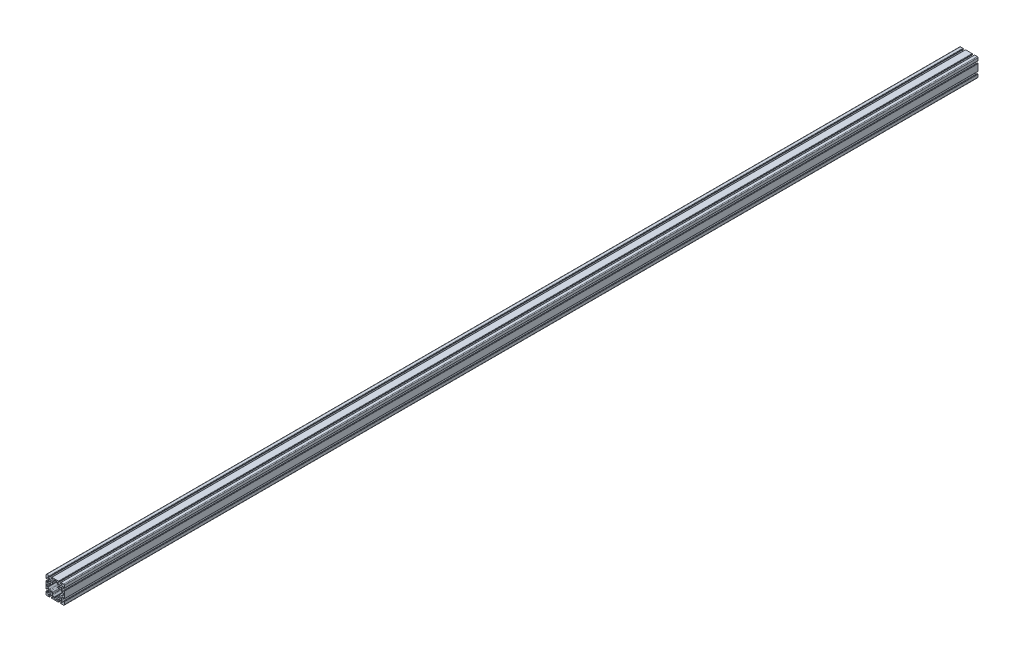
from build123d import *

# Parameters (mm, degrees)
SKETCH1_R      = 3.4
EXTRUDE1_DEPTH = 4000


with BuildPart() as part:
    # Sketch1 → Extrude1 (new body)
    with BuildSketch(Plane.XY):
        with BuildLine():
            Line((29.091242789, 26.036541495), (33.082657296, 30.027956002))
            ThreePointArc((33.082657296, 30.027956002), (33.329219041, 30.192703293), (33.62005845, 30.250554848))
            Line((33.62005845, 30.250554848), (33.955571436, 30.250554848))
            ThreePointArc((33.955571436, 30.250554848), (35.065729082, 29.790712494), (35.525571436, 28.680554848))
            Line((35.525571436, 28.680554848), (35.525571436, 25.777866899))
            ThreePointArc((35.525571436, 25.777866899), (35.985413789, 24.667709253), (37.095571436, 24.207866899))
            Line((37.095571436, 24.207866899), (38.43, 24.207866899))
            ThreePointArc((38.43, 24.207866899), (39.540157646, 24.667709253), (40, 25.777866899))
            Line((40, 25.777866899), (40, 32.933852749))
            Line((40, 32.933852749), (40, 36.83))
            ThreePointArc((40, 36.83), (39.071528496, 39.071528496), (36.83, 40))
            Line((36.83, 40), (25.540851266, 40))
            ThreePointArc((25.540851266, 40), (24.43069362, 39.540157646), (23.970851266, 38.43))
            Line((23.970851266, 38.43), (23.970851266, 37.249043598))
            ThreePointArc((23.970851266, 37.249043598), (24.43069362, 36.138885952), (25.540851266, 35.679043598))
            Line((25.540851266, 35.679043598), (28.625762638, 35.679043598))
            ThreePointArc((28.625762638, 35.679043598), (29.77116849, 35.239363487), (30.250554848, 34.11))
            Line((30.250554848, 34.11), (30.250554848, 33.62005845))
            ThreePointArc((30.250554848, 33.62005845), (30.192703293, 33.329219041), (30.027956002, 33.082657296))
            Line((30.027956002, 33.082657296), (26.036541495, 29.091242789))
            ThreePointArc((26.036541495, 29.091242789), (24.495530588, 28.061572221), (22.677784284, 27.7))
            Line((22.677784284, 27.7), (17.322215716, 27.7))
            ThreePointArc((17.322215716, 27.7), (15.504469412, 28.061572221), (13.963458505, 29.091242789))
            Line((13.963458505, 29.091242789), (9.90393336, 33.150767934))
            ThreePointArc((9.90393336, 33.150767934), (9.764102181, 33.360040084), (9.715, 33.606893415))
            Line((9.715, 33.606893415), (9.715, 34.096834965))
            ThreePointArc((9.715, 34.096834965), (10.178698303, 35.216301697), (11.298165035, 35.68))
            Line((11.298165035, 35.68), (14.642754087, 35.68))
            ThreePointArc((14.642754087, 35.68), (15.560045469, 36.059954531), (15.94, 36.977245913))
            Line((15.94, 36.977245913), (15.94, 38.194841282))
            ThreePointArc((15.94, 38.194841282), (15.411281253, 39.471281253), (14.134841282, 40))
            Line((14.134841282, 40), (6.984433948, 40))
            Line((6.984433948, 40), (-6.984433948, 40))
            Line((-6.984433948, 40), (-14.134841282, 40))
            ThreePointArc((-14.134841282, 40), (-15.411281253, 39.471281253), (-15.94, 38.194841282))
            Line((-15.94, 38.194841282), (-15.94, 36.977245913))
            ThreePointArc((-15.94, 36.977245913), (-15.560045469, 36.059954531), (-14.642754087, 35.68))
            Line((-14.642754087, 35.68), (-11.298165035, 35.68))
            ThreePointArc((-11.298165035, 35.68), (-10.178698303, 35.216301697), (-9.715, 34.096834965))
            Line((-9.715, 34.096834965), (-9.715, 33.606893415))
            ThreePointArc((-9.715, 33.606893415), (-9.764102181, 33.360040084), (-9.90393336, 33.150767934))
            Line((-9.90393336, 33.150767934), (-13.963458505, 29.091242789))
            ThreePointArc((-13.963458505, 29.091242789), (-15.504469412, 28.061572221), (-17.322215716, 27.7))
            Line((-17.322215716, 27.7), (-22.677784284, 27.7))
            ThreePointArc((-22.677784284, 27.7), (-24.495530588, 28.061572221), (-26.036541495, 29.091242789))
            Line((-26.036541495, 29.091242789), (-30.09606664, 33.150767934))
            ThreePointArc((-30.09606664, 33.150767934), (-30.235897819, 33.360040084), (-30.285, 33.606893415))
            Line((-30.285, 33.606893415), (-30.285, 34.096834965))
            ThreePointArc((-30.285, 34.096834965), (-29.821301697, 35.216301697), (-28.701834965, 35.68))
            Line((-28.701834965, 35.68), (-25.357245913, 35.68))
            ThreePointArc((-25.357245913, 35.68), (-24.439954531, 36.059954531), (-24.06, 36.977245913))
            Line((-24.06, 36.977245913), (-24.06, 38.194841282))
            ThreePointArc((-24.06, 38.194841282), (-24.588718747, 39.471281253), (-25.865158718, 40))
            Line((-25.865158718, 40), (-33.031395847, 40))
            Line((-33.031395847, 40), (-36.83, 40))
            ThreePointArc((-36.83, 40), (-39.071528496, 39.071528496), (-40, 36.83))
            Line((-40, 36.83), (-40, 33.318079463))
            Line((-40, 33.318079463), (-40, 25.865158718))
            ThreePointArc((-40, 25.865158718), (-39.471281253, 24.588718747), (-38.194841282, 24.06))
            Line((-38.194841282, 24.06), (-36.977245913, 24.06))
            ThreePointArc((-36.977245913, 24.06), (-36.059954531, 24.439954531), (-35.68, 25.357245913))
            Line((-35.68, 25.357245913), (-35.68, 28.680554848))
            ThreePointArc((-35.68, 28.680554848), (-35.220157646, 29.790712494), (-34.11, 30.250554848))
            Line((-34.11, 30.250554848), (-33.62005845, 30.250554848))
            ThreePointArc((-33.62005845, 30.250554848), (-33.329219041, 30.192703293), (-33.082657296, 30.027956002))
            Line((-33.082657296, 30.027956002), (-29.091242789, 26.036541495))
            ThreePointArc((-29.091242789, 26.036541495), (-28.061572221, 24.495530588), (-27.7, 22.677784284))
            Line((-27.7, 22.677784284), (-27.7, 17.322215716))
            ThreePointArc((-27.7, 17.322215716), (-28.061572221, 15.504469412), (-29.091242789, 13.963458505))
            Line((-29.091242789, 13.963458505), (-33.082657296, 9.972043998))
            ThreePointArc((-33.082657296, 9.972043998), (-33.329219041, 9.807296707), (-33.62005845, 9.749445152))
            Line((-33.62005845, 9.749445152), (-34.11, 9.749445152))
            ThreePointArc((-34.11, 9.749445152), (-35.220157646, 10.209287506), (-35.68, 11.319445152))
            Line((-35.68, 11.319445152), (-35.68, 14.642754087))
            ThreePointArc((-35.68, 14.642754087), (-36.059954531, 15.560045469), (-36.977245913, 15.94))
            Line((-36.977245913, 15.94), (-38.194841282, 15.94))
            ThreePointArc((-38.194841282, 15.94), (-39.471281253, 15.411281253), (-40, 14.134841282))
            Line((-40, 14.134841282), (-40, 7.016888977))
            Line((-40, 7.016888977), (-40, -7.016888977))
            Line((-40, -7.016888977), (-40, -14.447338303))
            ThreePointArc((-40, -14.447338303), (-39.540157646, -15.557495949), (-38.43, -16.017338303))
            Line((-38.43, -16.017338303), (-37.25, -16.017338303))
            ThreePointArc((-37.25, -16.017338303), (-36.139842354, -15.557495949), (-35.68, -14.447338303))
            Line((-35.68, -14.447338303), (-35.68, -11.319445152))
            ThreePointArc((-35.68, -11.319445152), (-35.220157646, -10.209287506), (-34.11, -9.749445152))
            Line((-34.11, -9.749445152), (-33.62005845, -9.749445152))
            ThreePointArc((-33.62005845, -9.749445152), (-33.329219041, -9.807296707), (-33.082657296, -9.972043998))
            Line((-33.082657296, -9.972043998), (-29.091242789, -13.963458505))
            ThreePointArc((-29.091242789, -13.963458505), (-28.061572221, -15.504469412), (-27.7, -17.322215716))
            Line((-27.7, -17.322215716), (-27.7, -22.677784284))
            ThreePointArc((-27.7, -22.677784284), (-28.061572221, -24.495530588), (-29.091242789, -26.036541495))
            Line((-29.091242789, -26.036541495), (-32.871776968, -29.817075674))
            ThreePointArc((-32.871776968, -29.817075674), (-33.10612883, -29.976640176), (-33.382654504, -30.039211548))
            Line((-33.382654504, -30.039211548), (-34.05520779, -30.062697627))
            ThreePointArc((-34.05520779, -30.062697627), (-35.200613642, -29.623017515), (-35.68, -28.493654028))
            Line((-35.68, -28.493654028), (-35.68, -25.59096608))
            ThreePointArc((-35.68, -25.59096608), (-36.139842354, -24.480808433), (-37.25, -24.02096608))
            Line((-37.25, -24.02096608), (-38.43, -24.02096608))
            ThreePointArc((-38.43, -24.02096608), (-39.540157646, -24.480808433), (-40, -25.59096608))
            Line((-40, -25.59096608), (-40, -33.019082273))
            Line((-40, -33.019082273), (-40, -36.83))
            ThreePointArc((-40, -36.83), (-39.071528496, -39.071528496), (-36.83, -40))
            Line((-36.83, -40), (-33, -40))
            Line((-33, -40), (-25.72307469, -40))
            ThreePointArc((-25.72307469, -40), (-24.612917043, -39.540157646), (-24.15307469, -38.43))
            Line((-24.15307469, -38.43), (-24.15307469, -37.25))
            ThreePointArc((-24.15307469, -37.25), (-24.612917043, -36.139842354), (-25.72307469, -35.68))
            Line((-25.72307469, -35.68), (-28.680554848, -35.68))
            ThreePointArc((-28.680554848, -35.68), (-29.790712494, -35.220157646), (-30.250554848, -34.11))
            Line((-30.250554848, -34.11), (-30.250554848, -33.62005845))
            ThreePointArc((-30.250554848, -33.62005845), (-30.192703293, -33.329219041), (-30.027956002, -33.082657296))
            Line((-30.027956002, -33.082657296), (-26.036541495, -29.091242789))
            ThreePointArc((-26.036541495, -29.091242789), (-24.495530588, -28.061572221), (-22.677784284, -27.7))
            Line((-22.677784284, -27.7), (-17.322215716, -27.7))
            ThreePointArc((-17.322215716, -27.7), (-15.504469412, -28.061572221), (-13.963458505, -29.091242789))
            Line((-13.963458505, -29.091242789), (-10.203784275, -32.85091702))
            ThreePointArc((-10.203784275, -32.85091702), (-10.044219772, -33.085268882), (-9.9816484, -33.361794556))
            Line((-9.9816484, -33.361794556), (-9.957433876, -34.05520779))
            ThreePointArc((-9.957433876, -34.05520779), (-10.397113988, -35.200613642), (-11.526477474, -35.68))
            Line((-11.526477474, -35.68), (-14.429165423, -35.68))
            ThreePointArc((-14.429165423, -35.68), (-15.539323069, -36.139842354), (-15.999165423, -37.25))
            Line((-15.999165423, -37.25), (-15.999165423, -38.43))
            ThreePointArc((-15.999165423, -38.43), (-15.539323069, -39.540157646), (-14.429165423, -40))
            Line((-14.429165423, -40), (-6.998716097, -40))
            Line((-6.998716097, -40), (6.998716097, -40))
            Line((6.998716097, -40), (14.424638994, -40))
            ThreePointArc((14.424638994, -40), (15.53479664, -39.540157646), (15.994638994, -38.43))
            Line((15.994638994, -38.43), (15.994638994, -37.032644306))
            ThreePointArc((15.994638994, -37.032644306), (15.53479664, -35.922486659), (14.424638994, -35.462644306))
            Line((14.424638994, -35.462644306), (11.382372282, -35.462644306))
            ThreePointArc((11.382372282, -35.462644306), (10.272214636, -35.002801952), (9.812372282, -33.892644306))
            Line((9.812372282, -33.892644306), (9.812372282, -33.55713132))
            ThreePointArc((9.812372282, -33.55713132), (9.870223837, -33.266291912), (10.034971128, -33.019730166))
            Line((10.034971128, -33.019730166), (13.963458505, -29.091242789))
            ThreePointArc((13.963458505, -29.091242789), (15.504469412, -28.061572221), (17.322215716, -27.7))
            Line((17.322215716, -27.7), (22.677784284, -27.7))
            ThreePointArc((22.677784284, -27.7), (24.495530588, -28.061572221), (26.036541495, -29.091242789))
            Line((26.036541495, -29.091242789), (29.794925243, -32.849626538))
            ThreePointArc((29.794925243, -32.849626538), (29.954489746, -33.083978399), (30.017061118, -33.360504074))
            Line((30.017061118, -33.360504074), (30.041320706, -34.05520779))
            ThreePointArc((30.041320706, -34.05520779), (29.601640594, -35.200613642), (28.472277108, -35.68))
            Line((28.472277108, -35.68), (25.569589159, -35.68))
            ThreePointArc((25.569589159, -35.68), (24.459431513, -36.139842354), (23.999589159, -37.25))
            Line((23.999589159, -37.25), (23.999589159, -38.43))
            ThreePointArc((23.999589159, -38.43), (24.459431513, -39.540157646), (25.569589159, -40))
            Line((25.569589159, -40), (32.999849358, -40))
            Line((32.999849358, -40), (36.83, -40))
            ThreePointArc((36.83, -40), (39.071528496, -39.071528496), (40, -36.83))
            Line((40, -36.83), (40, -33.025941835))
            Line((40, -33.025941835), (40, -25.777866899))
            ThreePointArc((40, -25.777866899), (39.540157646, -24.667709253), (38.43, -24.207866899))
            Line((38.43, -24.207866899), (37.25, -24.207866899))
            ThreePointArc((37.25, -24.207866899), (36.139842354, -24.667709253), (35.68, -25.777866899))
            Line((35.68, -25.777866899), (35.68, -28.680554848))
            ThreePointArc((35.68, -28.680554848), (35.220157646, -29.790712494), (34.11, -30.250554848))
            Line((34.11, -30.250554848), (33.62005845, -30.250554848))
            ThreePointArc((33.62005845, -30.250554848), (33.329219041, -30.192703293), (33.082657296, -30.027956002))
            Line((33.082657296, -30.027956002), (29.091242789, -26.036541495))
            ThreePointArc((29.091242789, -26.036541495), (28.061572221, -24.495530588), (27.7, -22.677784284))
            Line((27.7, -22.677784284), (27.7, -17.322215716))
            ThreePointArc((27.7, -17.322215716), (28.061572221, -15.504469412), (29.091242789, -13.963458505))
            Line((29.091242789, -13.963458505), (33.082657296, -9.972043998))
            ThreePointArc((33.082657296, -9.972043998), (33.329219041, -9.807296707), (33.62005845, -9.749445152))
            Line((33.62005845, -9.749445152), (34.11, -9.749445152))
            ThreePointArc((34.11, -9.749445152), (35.220157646, -10.209287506), (35.68, -11.319445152))
            Line((35.68, -11.319445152), (35.68, -14.222133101))
            ThreePointArc((35.68, -14.222133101), (36.139842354, -15.332290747), (37.25, -15.792133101))
            Line((37.25, -15.792133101), (38.43, -15.792133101))
            ThreePointArc((38.43, -15.792133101), (39.540157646, -15.332290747), (40, -14.222133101))
            Line((40, -14.222133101), (40, -7.021415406))
            Line((40, -7.021415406), (40, 7.021415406))
            Line((40, 7.021415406), (40, 14.222133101))
            ThreePointArc((40, 14.222133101), (39.540157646, 15.332290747), (38.43, 15.792133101))
            Line((38.43, 15.792133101), (37.25, 15.792133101))
            ThreePointArc((37.25, 15.792133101), (36.139842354, 15.332290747), (35.68, 14.222133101))
            Line((35.68, 14.222133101), (35.68, 11.319445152))
            ThreePointArc((35.68, 11.319445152), (35.220157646, 10.209287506), (34.11, 9.749445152))
            Line((34.11, 9.749445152), (33.62005845, 9.749445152))
            ThreePointArc((33.62005845, 9.749445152), (33.329219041, 9.807296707), (33.082657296, 9.972043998))
            Line((33.082657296, 9.972043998), (29.091242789, 13.963458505))
            ThreePointArc((29.091242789, 13.963458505), (28.061572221, 15.504469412), (27.7, 17.322215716))
            Line((27.7, 17.322215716), (27.7, 22.677784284))
            ThreePointArc((27.7, 22.677784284), (28.061572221, 24.495530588), (29.091242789, 26.036541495))
        make_face()
        with Locations((-20, 20)):
            Circle(SKETCH1_R, mode=Mode.SUBTRACT)
        with Locations((20, 20)):
            Circle(SKETCH1_R, mode=Mode.SUBTRACT)
        with Locations((20, -20)):
            Circle(SKETCH1_R, mode=Mode.SUBTRACT)
        with Locations((-20, -20)):
            Circle(SKETCH1_R, mode=Mode.SUBTRACT)
        with BuildLine():
            Line((17.07, 12.32), (22.657784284, 12.32))
            ThreePointArc((22.657784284, 12.32), (24.475530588, 11.958427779), (26.016541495, 10.928757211))
            Line((26.016541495, 10.928757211), (31.143879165, 5.80141954))
            ThreePointArc((31.143879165, 5.80141954), (31.555896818, 5.526118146), (32.041904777, 5.429445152))
            Line((32.041904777, 5.429445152), (34.41, 5.429445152))
            ThreePointArc((34.41, 5.429445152), (35.308025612, 5.057470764), (35.68, 4.159445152))
            Line((35.68, 4.159445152), (35.68, -4.159445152))
            ThreePointArc((35.68, -4.159445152), (35.308025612, -5.057470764), (34.41, -5.429445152))
            Line((34.41, -5.429445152), (32.041904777, -5.429445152))
            ThreePointArc((32.041904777, -5.429445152), (31.555896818, -5.526118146), (31.143879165, -5.80141954))
            Line((31.143879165, -5.80141954), (26.016541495, -10.928757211))
            ThreePointArc((26.016541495, -10.928757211), (24.475530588, -11.958427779), (22.657784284, -12.32))
            Line((22.657784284, -12.32), (17.07, -12.32))
            ThreePointArc((17.07, -12.32), (13.711242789, -13.711242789), (12.32, -17.07))
            Line((12.32, -17.07), (12.32, -22.657784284))
            ThreePointArc((12.32, -22.657784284), (11.958427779, -24.475530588), (10.928757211, -26.016541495))
            Line((10.928757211, -26.016541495), (5.80141954, -31.143879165))
            ThreePointArc((5.80141954, -31.143879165), (5.526118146, -31.555896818), (5.429445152, -32.041904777))
            Line((5.429445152, -32.041904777), (5.429445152, -34.41))
            ThreePointArc((5.429445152, -34.41), (5.057470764, -35.308025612), (4.159445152, -35.68))
            Line((4.159445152, -35.68), (-4.159445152, -35.68))
            ThreePointArc((-4.159445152, -35.68), (-5.057470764, -35.308025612), (-5.429445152, -34.41))
            Line((-5.429445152, -34.41), (-5.429445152, -32.041904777))
            ThreePointArc((-5.429445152, -32.041904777), (-5.526118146, -31.555896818), (-5.80141954, -31.143879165))
            Line((-5.80141954, -31.143879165), (-10.928757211, -26.016541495))
            ThreePointArc((-10.928757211, -26.016541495), (-11.958427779, -24.475530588), (-12.32, -22.657784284))
            Line((-12.32, -22.657784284), (-12.32, -17.07))
            ThreePointArc((-12.32, -17.07), (-13.711242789, -13.711242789), (-17.07, -12.32))
            Line((-17.07, -12.32), (-22.657784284, -12.32))
            ThreePointArc((-22.657784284, -12.32), (-24.475530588, -11.958427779), (-26.016541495, -10.928757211))
            Line((-26.016541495, -10.928757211), (-31.143879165, -5.80141954))
            ThreePointArc((-31.143879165, -5.80141954), (-31.555896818, -5.526118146), (-32.041904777, -5.429445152))
            Line((-32.041904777, -5.429445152), (-34.41, -5.429445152))
            ThreePointArc((-34.41, -5.429445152), (-35.308025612, -5.057470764), (-35.68, -4.159445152))
            Line((-35.68, -4.159445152), (-35.68, 4.159445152))
            ThreePointArc((-35.68, 4.159445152), (-35.308025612, 5.057470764), (-34.41, 5.429445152))
            Line((-34.41, 5.429445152), (-32.041904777, 5.429445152))
            ThreePointArc((-32.041904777, 5.429445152), (-31.555896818, 5.526118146), (-31.143879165, 5.80141954))
            Line((-31.143879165, 5.80141954), (-26.016541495, 10.928757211))
            ThreePointArc((-26.016541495, 10.928757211), (-24.475530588, 11.958427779), (-22.657784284, 12.32))
            Line((-22.657784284, 12.32), (-17.07, 12.32))
            ThreePointArc((-17.07, 12.32), (-13.711242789, 13.711242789), (-12.32, 17.07))
            Line((-12.32, 17.07), (-12.32, 22.657784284))
            ThreePointArc((-12.32, 22.657784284), (-11.958427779, 24.475530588), (-10.928757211, 26.016541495))
            Line((-10.928757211, 26.016541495), (-5.80141954, 31.143879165))
            ThreePointArc((-5.80141954, 31.143879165), (-5.526118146, 31.555896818), (-5.429445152, 32.041904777))
            Line((-5.429445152, 32.041904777), (-5.429445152, 34.41))
            ThreePointArc((-5.429445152, 34.41), (-5.057470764, 35.308025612), (-4.159445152, 35.68))
            Line((-4.159445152, 35.68), (4.159445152, 35.68))
            ThreePointArc((4.159445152, 35.68), (5.057470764, 35.308025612), (5.429445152, 34.41))
            Line((5.429445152, 34.41), (5.429445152, 32.041904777))
            ThreePointArc((5.429445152, 32.041904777), (5.526118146, 31.555896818), (5.80141954, 31.143879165))
            Line((5.80141954, 31.143879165), (10.928757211, 26.016541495))
            ThreePointArc((10.928757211, 26.016541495), (11.958427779, 24.475530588), (12.32, 22.657784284))
            Line((12.32, 22.657784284), (12.32, 17.07))
            ThreePointArc((12.32, 17.07), (13.711242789, 13.711242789), (17.07, 12.32))
        make_face(mode=Mode.SUBTRACT)
    extrude(amount=-EXTRUDE1_DEPTH)


solid = part.part
